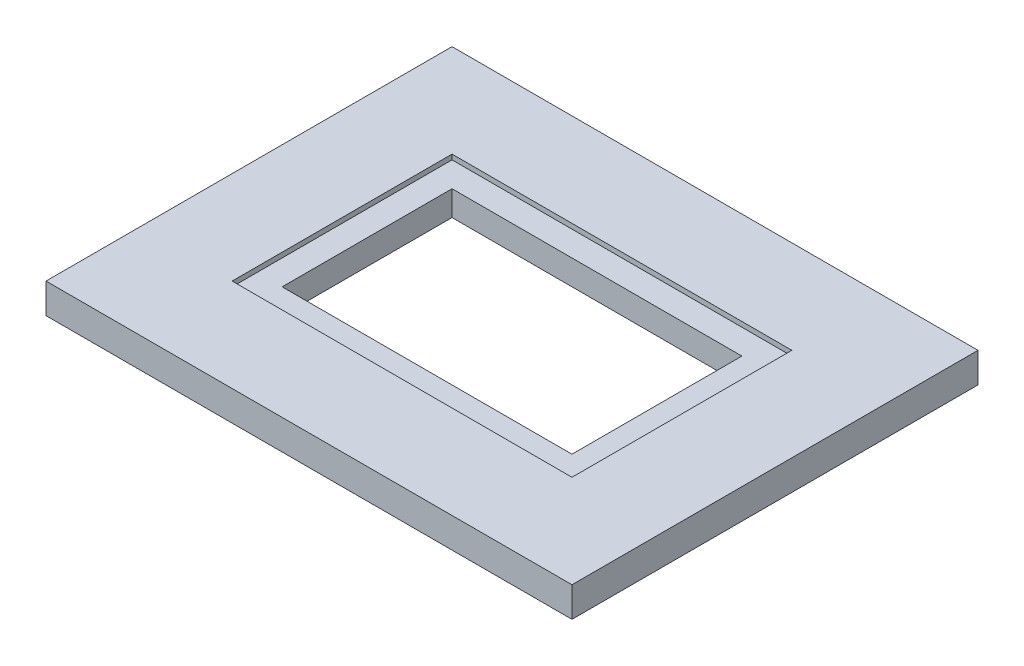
from build123d import *

# Parameters (mm, degrees)
SKETCH1_W           = 334.15
SKETCH1_H           = 257.95
SKETCH1_W_2         = 184.15
SKETCH1_H_2         = 107.95
BOSS_EXTRUDE1_DEPTH = 19.05
SKETCH2_W           = 215.9
SKETCH2_H           = 139.7
SKETCH2_W_2         = 184.15
SKETCH2_H_2         = 107.95
CUT_EXTRUDE1_DEPTH  = 3.175


with BuildPart() as part:
    # Sketch1 → Boss-Extrude1 (new body)
    with BuildSketch(Plane(origin=(0, 0, 0), x_dir=(1, 0, 0), z_dir=(0, 1, 0))):
        Rectangle(SKETCH1_W, SKETCH1_H)
        Rectangle(SKETCH1_W_2, SKETCH1_H_2, mode=Mode.SUBTRACT)
    extrude(amount=BOSS_EXTRUDE1_DEPTH)

    # Sketch2 → Cut-Extrude1 (cut)
    with BuildSketch(Plane(origin=(0, 19.05, 0), x_dir=(1, 0, 0), z_dir=(0, 1, 0))):
        Rectangle(SKETCH2_W, SKETCH2_H)
        Rectangle(SKETCH2_W_2, SKETCH2_H_2, mode=Mode.SUBTRACT)
    extrude(amount=-CUT_EXTRUDE1_DEPTH, mode=Mode.SUBTRACT)


solid = part.part
